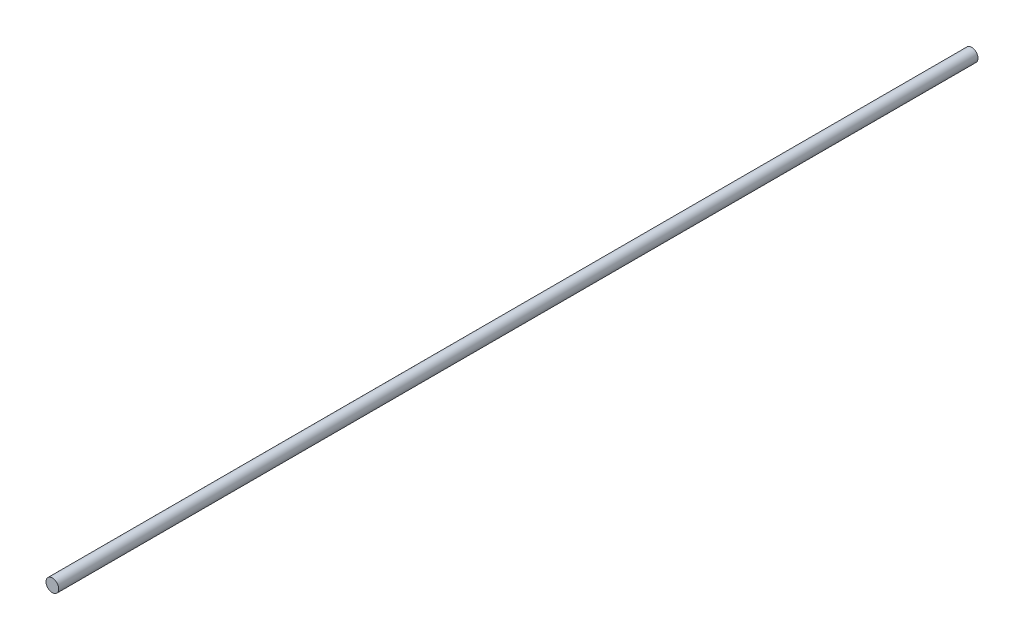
ISO-10303-21;
HEADER;
FILE_DESCRIPTION(('STEP AP214'),'2;1');
FILE_NAME('part.step','',(''),(''),'','','');
FILE_SCHEMA(('AUTOMOTIVE_DESIGN { 1 0 10303 214 1 1 1 1 }'));
ENDSEC;
DATA;
#1=APPLICATION_CONTEXT('core data for automotive mechanical design processes');
#2=APPLICATION_PROTOCOL_DEFINITION('international standard','automotive_design',2000,#1);
#3=PRODUCT_CONTEXT('',#1,'mechanical');
#4=PRODUCT('Part','Part','',(#3));
#5=PRODUCT_RELATED_PRODUCT_CATEGORY('part','',(#4));
#6=PRODUCT_DEFINITION_FORMATION('','',#4);
#7=PRODUCT_DEFINITION_CONTEXT('part definition',#1,'design');
#8=PRODUCT_DEFINITION('design','',#6,#7);
#9=PRODUCT_DEFINITION_SHAPE('','',#8);
#10=(LENGTH_UNIT() NAMED_UNIT(*) SI_UNIT(.MILLI.,.METRE.));
#11=(NAMED_UNIT(*) PLANE_ANGLE_UNIT() SI_UNIT($,.RADIAN.));
#12=(NAMED_UNIT(*) SI_UNIT($,.STERADIAN.) SOLID_ANGLE_UNIT());
#13=UNCERTAINTY_MEASURE_WITH_UNIT(LENGTH_MEASURE(1.E-05),#10,'distance_accuracy_value','');
#14=(GEOMETRIC_REPRESENTATION_CONTEXT(3) GLOBAL_UNCERTAINTY_ASSIGNED_CONTEXT((#13)) GLOBAL_UNIT_ASSIGNED_CONTEXT((#10,
#11,#12)) REPRESENTATION_CONTEXT('',''));
#15=CARTESIAN_POINT('',(0.,0.,0.));
#16=DIRECTION('',(0.,0.,1.));
#17=DIRECTION('',(1.,0.,0.));
#18=AXIS2_PLACEMENT_3D('',#15,#16,#17);
#19=CARTESIAN_POINT('',(0.,0.,457.2));
#20=DIRECTION('',(0.,0.,-1.));
#21=DIRECTION('',(-1.,0.,0.));
#22=AXIS2_PLACEMENT_3D('',#19,#20,#21);
#23=CYLINDRICAL_SURFACE('',#22,3.175);
#24=CARTESIAN_POINT('',(0.,0.,457.2));
#25=DIRECTION('',(0.,0.,1.));
#26=DIRECTION('',(1.,0.,0.));
#27=AXIS2_PLACEMENT_3D('',#24,#25,#26);
#28=CIRCLE('',#27,3.175);
#29=CARTESIAN_POINT('',(3.175,0.,457.2));
#30=VERTEX_POINT('',#29);
#31=EDGE_CURVE('E10',#30,#30,#28,.T.);
#32=ORIENTED_EDGE('',*,*,#31,.F.);
#33=EDGE_LOOP('',(#32));
#34=FACE_BOUND('',#33,.T.);
#35=CARTESIAN_POINT('',(0.,0.,0.));
#36=DIRECTION('',(0.,0.,1.));
#37=DIRECTION('',(1.,0.,0.));
#38=AXIS2_PLACEMENT_3D('',#35,#36,#37);
#39=CIRCLE('',#38,3.175);
#40=CARTESIAN_POINT('',(3.175,0.,0.));
#41=VERTEX_POINT('',#40);
#42=EDGE_CURVE('E32',#41,#41,#39,.T.);
#43=ORIENTED_EDGE('',*,*,#42,.T.);
#44=EDGE_LOOP('',(#43));
#45=FACE_BOUND('',#44,.T.);
#46=ADVANCED_FACE('F29',(#34,#45),#23,.T.);
#47=CARTESIAN_POINT('',(0.,0.,457.2));
#48=DIRECTION('',(0.,0.,1.));
#49=DIRECTION('',(1.,0.,0.));
#50=AXIS2_PLACEMENT_3D('',#47,#48,#49);
#51=PLANE('',#50);
#52=ORIENTED_EDGE('',*,*,#31,.T.);
#53=EDGE_LOOP('',(#52));
#54=FACE_BOUND('',#53,.T.);
#55=ADVANCED_FACE('F44',(#54),#51,.T.);
#56=CARTESIAN_POINT('',(0.,0.,0.));
#57=DIRECTION('',(0.,0.,1.));
#58=DIRECTION('',(1.,0.,0.));
#59=AXIS2_PLACEMENT_3D('',#56,#57,#58);
#60=PLANE('',#59);
#61=ORIENTED_EDGE('',*,*,#42,.F.);
#62=EDGE_LOOP('',(#61));
#63=FACE_BOUND('',#62,.T.);
#64=ADVANCED_FACE('F42',(#63),#60,.F.);
#65=CLOSED_SHELL('',(#46,#55,#64));
#66=MANIFOLD_SOLID_BREP('B2',#65);
#67=ADVANCED_BREP_SHAPE_REPRESENTATION('',(#18,#66),#14);
#68=SHAPE_DEFINITION_REPRESENTATION(#9,#67);
ENDSEC;
END-ISO-10303-21;
